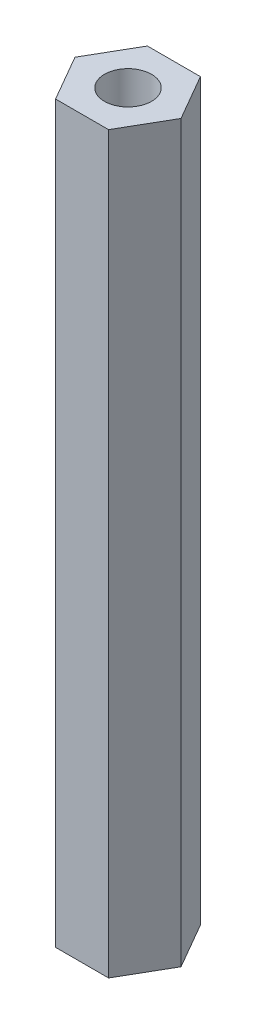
from build123d import *

# Parameters (mm, degrees)
SKETCH1_R           = 1.6256
BOSS_EXTRUDE1_DEPTH = 50.8


with BuildPart() as part:
    # Sketch1 → Boss-Extrude1 (new body)
    with BuildSketch(Plane(origin=(0, 0, 0), x_dir=(1, 0, 0), z_dir=(0, 1, 0))):
        Polygon((1.833087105, 3.175), (-1.833087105, 3.175), (-3.666174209, 0), (-1.833087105, -3.175), (1.833087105, -3.175), (3.666174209, 0), align=None)
        with Locations(Location((0, 0, 0), (0, 0, 270))):
            Circle(SKETCH1_R, mode=Mode.SUBTRACT)
    extrude(amount=BOSS_EXTRUDE1_DEPTH)


solid = part.part
